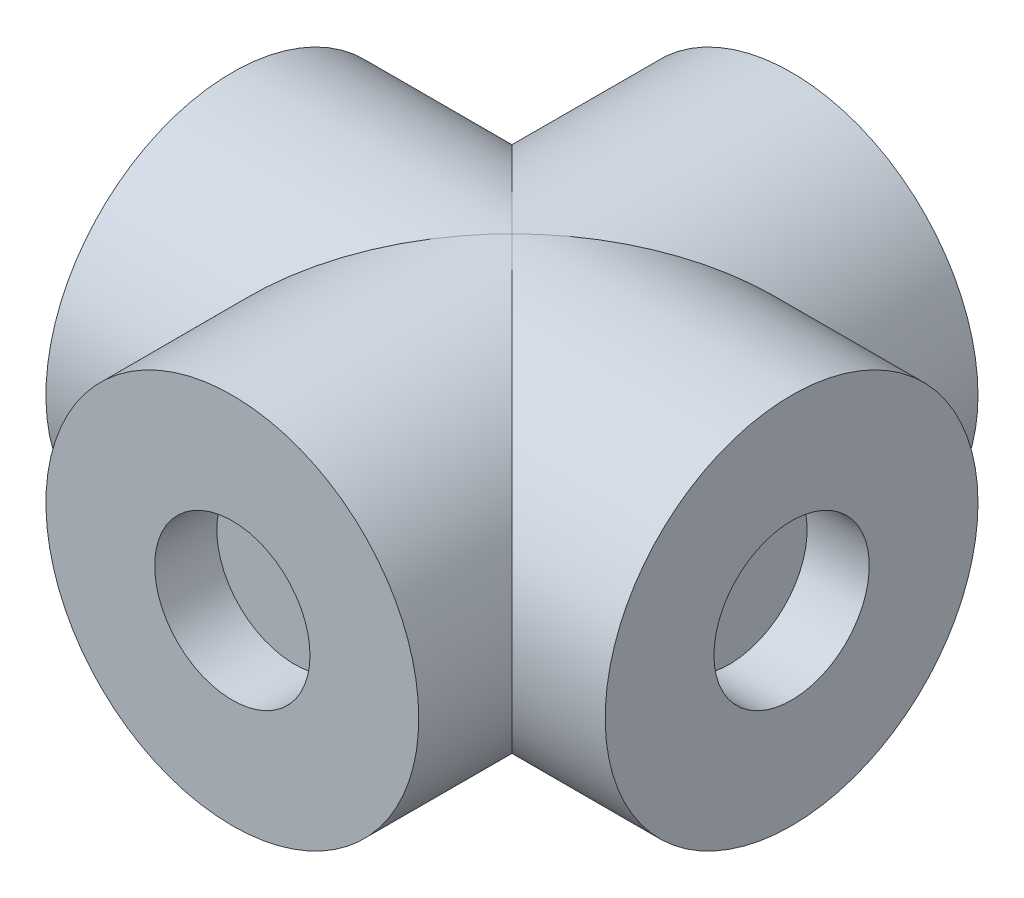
from build123d import *

# Parameters (mm, degrees)
SKETCH2_R           = 30
BOSS_EXTRUDE1_DEPTH = 45
SKETCH4_R           = 12.5
CUT_EXTRUDE1_DEPTH  = 10
SKETCH5_R           = 30
BOSS_EXTRUDE2_DEPTH = 45
SKETCH6_R           = 12.5
CUT_EXTRUDE2_DEPTH  = 10


with BuildPart() as part:
    # Sketch2 → Boss-Extrude1 (new, symmetric)
    with BuildSketch(Plane.XY):
        with Locations(Location((0, 0, 0), (0, 0, 180))):
            Circle(SKETCH2_R)
    extrude(amount=BOSS_EXTRUDE1_DEPTH, both=True)

    # Sketch4 → Cut-Extrude1 (cut)
    with BuildSketch(Plane.XY.offset(45)):
        Circle(SKETCH4_R)
    cut_extrude1 = extrude(amount=-CUT_EXTRUDE1_DEPTH, mode=Mode.SUBTRACT)

    # Mirror1: Cut-Extrude1 across plane
    add(cut_extrude1.mirror(Plane.XY), mode=Mode.SUBTRACT)

    # Sketch5 → Boss-Extrude2 (add, symmetric)
    with BuildSketch(Plane(origin=(0, 0, 0), x_dir=(0, 0, -1), z_dir=(1, 0, 0))):
        with Locations(Location((0, 0, 0), (0, 0, 270))):
            Circle(SKETCH5_R)
    extrude(amount=BOSS_EXTRUDE2_DEPTH, both=True)

    # Sketch6 → Cut-Extrude2 (cut)
    with BuildSketch(Plane.ZY.offset(45)):
        Circle(SKETCH6_R)
    cut_extrude2 = extrude(amount=-CUT_EXTRUDE2_DEPTH, mode=Mode.SUBTRACT)

    # Mirror2: Cut-Extrude2 across plane
    add(cut_extrude2.mirror(Plane(origin=(0, 0, 0), x_dir=(0, 0, 1), z_dir=(1, 0, 0))), mode=Mode.SUBTRACT)


solid = part.part
